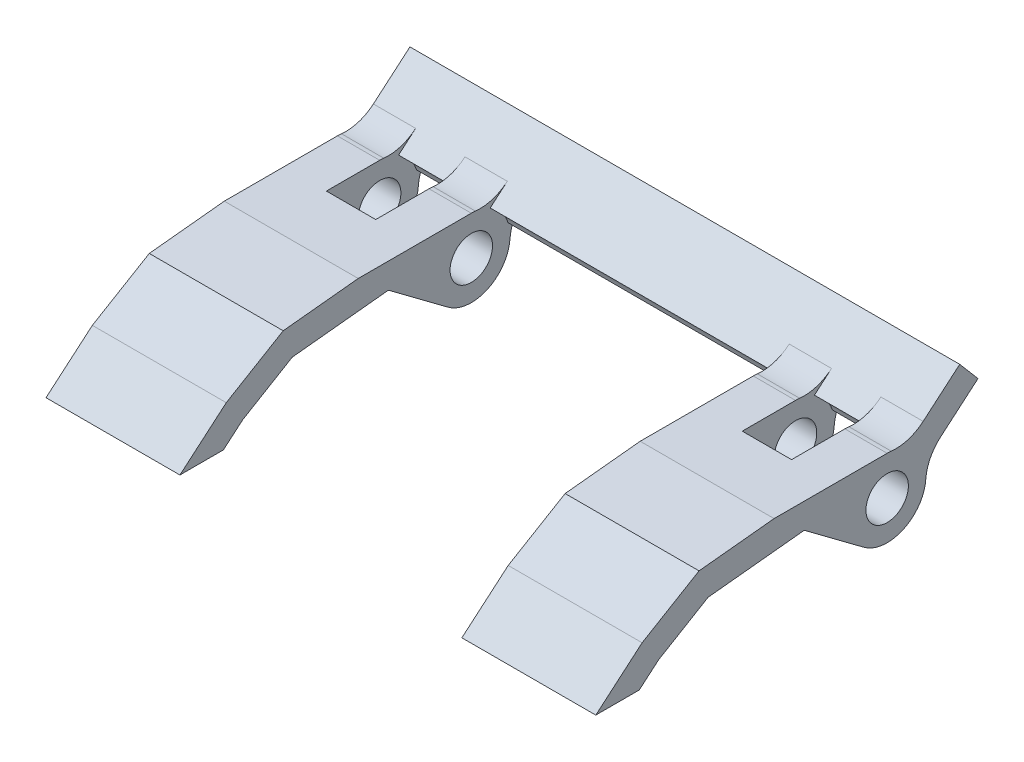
from build123d import *

# Parameters (mm, degrees)
SKETCH_1_W               = 91
SKETCH_1_H               = 36
EXTRUDE_1_DEPTH          = 17
SHELL_1_T                = -1.5
FILLET_1_R               = 2.5
CUT_EXTRUDE_1_REACH      = 53.327
SKETCH_2_W               = 72.5
SKETCH_2_H               = 23
EXTRUDE_2_DEPTH          = 6.5
MIRROR_2_COPY_1_DEPTH    = 6.5
CUT_EXTRUDE_2_REACH      = 96.308
SKETCH_5_W               = 87
SKETCH_5_H               = 31.999999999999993
EXTRUDE_3_DEPTH          = 1.5
SKETCH_6_W               = 3
SKETCH_6_H               = 18
CUT_EXTRUDE_3_DEPTH      = 1.5
PATTERN_LINEAR_1_COUNT   = 3
PATTERN_LINEAR_1_PITCH   = 6
MIRROR_3_COPY_1_SKETCH_W = 3
MIRROR_3_COPY_1_SKETCH_H = 18
MIRROR_3_COPY_1_DEPTH    = 1.5
MIRROR_3_COPY_2_SKETCH_W = 3
MIRROR_3_COPY_2_SKETCH_H = 18
MIRROR_3_COPY_2_DEPTH    = 1.5
EXTRUDE_4_DEPTH          = 1.5
SKETCH_8_R               = 1.5000000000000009
CUT_EXTRUDE_4_DEPTH      = 3
CUT_EXTRUDE_START        = -17
SKETCH_9_W               = 90.99999999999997
SKETCH_9_H               = 36
CUT_EXTRUDE_5_DEPTH      = 17
SKETCH_10_R              = 1.5057624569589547
EXTRUDE_5_DEPTH          = 39
CUT_EXTRUDE_START_2      = -6.601661
CUT_EXTRUDE_6_DEPTH      = 6.601661
EXTRUDE_6_DEPTH          = 39
SKETCH_14_W              = 19.99999999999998
SKETCH_14_H              = 19.910096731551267
CUT_EXTRUDE_7_DEPTH      = 39
SKETCH_15_W              = 31.999999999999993
SKETCH_15_H              = 8.74543491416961
CUT_EXTRUDE_8_DEPTH      = 87
FILLET_4_R               = 3


with BuildPart() as part:
    # Sketch 1 → Extrude 1 (new body)
    with BuildSketch(Plane(origin=(0, 0, 0), x_dir=(1, 0, 0), z_dir=(0, 1, 0))):
        Rectangle(SKETCH_1_W, SKETCH_1_H)
    extrude(amount=EXTRUDE_1_DEPTH)

    # Shell 1
    shell_1_openings = [part.faces().sort_by_distance(p)[0] for p in [
        (0, 17, 0),
    ]]
    offset(amount=SHELL_1_T, openings=shell_1_openings, kind=Kind.INTERSECTION)

    # Fillet 1
    fillet_1_edges = [part.edges().sort_by_distance(p)[0] for p in [
        (45.49999999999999, 8.5, 18),
        (-45.50000000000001, 8.5, 18),
        (-45.50000000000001, 8.5, -18),
        (45.49999999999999, 8.5, -18),
    ]]
    fillet(fillet_1_edges, radius=FILLET_1_R)

    # Sketch 2 → Cut-Extrude 1 (cut, up to next)
    with BuildSketch(Plane(origin=(0, 1.5, 0), x_dir=(1, 0, 0), z_dir=(0, 1, 0)), mode=Mode.PRIVATE) as cut_extrude_1_sk1:
        Rectangle(SKETCH_2_W, SKETCH_2_H)
    cut_extrude_1_tool1 = extrude(cut_extrude_1_sk1.sketch, amount=-CUT_EXTRUDE_1_REACH, mode=Mode.PRIVATE) & part.part
    add(cut_extrude_1_tool1.solids().sort_by_distance((0, 1.5, 0))[0], mode=Mode.SUBTRACT)

    # Sketch 3 → Extrude 2 (add)
    with BuildSketch(Plane(origin=(0, 1.5, 0), x_dir=(1, 0, 0), z_dir=(0, 1, 0))):
        with BuildLine():
            Line((-44.00000000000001, 16.499999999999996), (-41, 16.5))
            ThreePointArc((-41, 16.5), (-38.878679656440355, 11.378679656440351), (-44.00000000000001, 13.499999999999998))
            Line((-44.00000000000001, 13.499999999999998), (-44.00000000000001, 16.499999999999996))
        make_face()
    extrude_2 = extrude(amount=EXTRUDE_2_DEPTH)

    # Mirror 1: Extrude 2 across plane
    add(extrude_2.mirror(Plane(origin=(0, 0, 0), x_dir=(0, 0, 1), z_dir=(1, 0, 0))))

    # Mirror 2: Extrude 2 across plane
    add(extrude_2.mirror(Plane.XY))

    # Mirror 2 copy 1 sketch → Mirror 2 copy 1 (add)
    with BuildSketch(Plane(origin=(0, 1.5, 0), x_dir=(-1, 0, 0), z_dir=(0, 1, 0))):
        with BuildLine():
            Line((-44.00000000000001, 16.499999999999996), (-41, 16.5))
            ThreePointArc((-41, 16.5), (-38.878679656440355, 11.378679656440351), (-44.00000000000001, 13.499999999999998))
            Line((-44.00000000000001, 13.499999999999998), (-44.00000000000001, 16.499999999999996))
        make_face()
    extrude(amount=MIRROR_2_COPY_1_DEPTH)

    # Sketch 4 → Cut-Extrude 2 (cut, up to next)
    with BuildSketch(Plane(origin=(45.49999999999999, 0, 0), x_dir=(0, 0, -1), z_dir=(1, 0, 0)), mode=Mode.PRIVATE) as cut_extrude_2_sk1:
        Polygon((-6.500000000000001, 15.5), (6.499999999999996, 15.500000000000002), (6.499999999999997, 8.5), (-6.500000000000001, 8.5), align=None)
    cut_extrude_2_tool1 = extrude(cut_extrude_2_sk1.sketch, amount=-CUT_EXTRUDE_2_REACH, mode=Mode.PRIVATE) & part.part
    add(cut_extrude_2_tool1.solids().sort_by_distance((45.5, 12, 0))[0], mode=Mode.SUBTRACT)

    # Sketch 9 → Cut-Extrude 5 (cut)
    with BuildSketch(Plane(origin=(0, 17, 0), x_dir=(1, 0, 0), z_dir=(0, 1, 0)).offset(CUT_EXTRUDE_START)):
        Rectangle(SKETCH_9_W, SKETCH_9_H)
    extrude(amount=CUT_EXTRUDE_5_DEPTH, mode=Mode.SUBTRACT)


with BuildPart() as body_2:
    # Sketch 5 → Extrude 3 (new body)
    with BuildSketch(Plane(origin=(0, 17, 0), x_dir=(1, 0, 0), z_dir=(0, 1, 0))):
        Rectangle(SKETCH_5_W, SKETCH_5_H)
    extrude(amount=EXTRUDE_3_DEPTH)

    # Sketch 6 → Cut-Extrude 3 (cut)
    with BuildSketch(Plane(origin=(0, 18.500000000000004, 0), x_dir=(1, 0, 0), z_dir=(0, 1, 0))):
        with Locations((-39, 1.78e-15)):
            Rectangle(SKETCH_6_W, SKETCH_6_H)
    cut_extrude_3 = extrude(amount=-CUT_EXTRUDE_3_DEPTH, mode=Mode.SUBTRACT)

    # Pattern Linear 1: Cut-Extrude 3 ×3
    with Locations(*[(i * PATTERN_LINEAR_1_PITCH, 0, 0) for i in range(1, PATTERN_LINEAR_1_COUNT)]):
        add(cut_extrude_3, mode=Mode.SUBTRACT)

    # Mirror 3: Cut-Extrude 3 across plane
    add(cut_extrude_3.mirror(Plane(origin=(0, 0, 0), x_dir=(0, 0, 1), z_dir=(1, 0, 0))), mode=Mode.SUBTRACT)

    # Mirror 3 copy 1 sketch → Mirror 3 copy 1 (cut)
    with BuildSketch(Plane(origin=(-6, 18.500000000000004, 0), x_dir=(-1, 0, 0), z_dir=(0, 1, 0))):
        with Locations((-39, -1.78e-15)):
            Rectangle(MIRROR_3_COPY_1_SKETCH_W, MIRROR_3_COPY_1_SKETCH_H)
    extrude(amount=-MIRROR_3_COPY_1_DEPTH, mode=Mode.SUBTRACT)

    # Mirror 3 copy 2 sketch → Mirror 3 copy 2 (cut)
    with BuildSketch(Plane(origin=(-12, 18.500000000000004, 0), x_dir=(-1, 0, 0), z_dir=(0, 1, 0))):
        with Locations((-39, -1.78e-15)):
            Rectangle(MIRROR_3_COPY_2_SKETCH_W, MIRROR_3_COPY_2_SKETCH_H)
    extrude(amount=-MIRROR_3_COPY_2_DEPTH, mode=Mode.SUBTRACT)

    # Sketch 7 → Extrude 4 (add, symmetric)
    with BuildSketch(Plane(origin=(-15, 0, 0), x_dir=(0, 0, -1), z_dir=(1, 0, 0))):
        with BuildLine():
            Line((6.464733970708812, 22.52606042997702), (4.999367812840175, 18.500000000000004))
            Line((4.999367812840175, 18.500000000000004), (12.283811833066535, 18.500000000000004))
            Line((12.283811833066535, 18.500000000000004), (12.283811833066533, 21.5))
            ThreePointArc((12.283811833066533, 21.5), (9.804756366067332, 24.45442325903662), (6.464733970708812, 22.52606042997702))
        make_face()
    extrude_4 = extrude(amount=EXTRUDE_4_DEPTH, both=True)

    # Sketch 8 → Cut-Extrude 4 (cut)
    with BuildSketch(Plane(origin=(-13.500000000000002, 0, 0), x_dir=(0, 0, -1), z_dir=(1, 0, 0))):
        with Locations((9.283811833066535, 21.5)):
            Circle(SKETCH_8_R)
    cut_extrude_4 = extrude(amount=-CUT_EXTRUDE_4_DEPTH, mode=Mode.SUBTRACT)

    # Mirror 4: Extrude 4, Cut-Extrude 4 across plane
    add(extrude_4.mirror(Plane(origin=(0, 0, 0), x_dir=(0, 0, 1), z_dir=(1, 0, 0))))
    add(cut_extrude_4.mirror(Plane(origin=(0, 0, 0), x_dir=(0, 0, 1), z_dir=(1, 0, 0))), mode=Mode.SUBTRACT)

    # Sketch 15 → Cut-Extrude 8 (cut)
    with BuildSketch(Plane.ZY.offset(-43.49999999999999)):
        with Locations((0, 21.372717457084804)):
            Rectangle(SKETCH_15_W, SKETCH_15_H)
    extrude(amount=CUT_EXTRUDE_8_DEPTH, mode=Mode.SUBTRACT)


with BuildPart() as body_2_2:
    # Sketch 10 → Extrude 5 (new body)
    with BuildSketch(Plane(origin=(43.49999999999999, 0, 0), x_dir=(0, 0, -1), z_dir=(1, 0, 0))):
        with BuildLine():
            Line((10.63032139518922, 23.901020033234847), (14.436315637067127, 27.143612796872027))
            Line((14.436315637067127, 27.143612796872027), (15.733352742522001, 25.621215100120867))
            Line((15.733352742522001, 25.621215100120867), (11.90248648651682, 22.35743212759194))
            ThreePointArc((11.90248648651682, 22.35743212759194), (10.894482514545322, 19.26689239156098), (7.643849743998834, 19.296799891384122))
            Line((7.643849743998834, 19.296799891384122), (3.4083119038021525, 22.460619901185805))
            Line((3.4083119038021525, 22.460619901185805), (-3.4117957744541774, 21.755763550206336))
            Line((-3.4117957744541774, 21.755763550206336), (-6.92556374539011, 19.668482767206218))
            Line((-6.92556374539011, 19.668482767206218), (-8.296973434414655, 18.500000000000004))
            Line((-8.296973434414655, 18.500000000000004), (-11.380798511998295, 18.500000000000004))
            Line((-11.380798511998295, 18.500000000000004), (-8.093206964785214, 21.301127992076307))
            Line((-8.093206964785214, 21.301127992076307), (-4.054998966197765, 23.699941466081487))
            Line((-4.054998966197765, 23.699941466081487), (1.2673031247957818, 24.25))
            Line((1.2673031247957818, 24.25), (9.289574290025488, 24.25))
            ThreePointArc((9.289574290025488, 24.25), (9.982284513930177, 24.161325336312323), (10.63032139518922, 23.901020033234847))
        make_face()
        with Locations((9.289574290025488, 21.5)):
            Circle(SKETCH_10_R, mode=Mode.SUBTRACT)
    extrude(amount=EXTRUDE_5_DEPTH)

    # Sketch 11 → Cut-Extrude 6 (cut)
    with BuildSketch(Plane.XZ.offset(-18.500000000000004).offset(CUT_EXTRUDE_START_2)):
        Polygon((46.49999999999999, 11.380798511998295), (46.49999999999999, -12.03957429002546), (49.99999999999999, -12.039574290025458), (49.99999999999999, 11.380798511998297), align=None)
        Polygon((53, 11.380798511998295), (72.99999999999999, 11.380798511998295), (72.99999999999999, -12.03957429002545), (53.00000000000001, -12.039574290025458), align=None)
        Polygon((75.99999999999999, 11.380798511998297), (75.99999999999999, -12.03957429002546), (79.49999999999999, -12.03957429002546), (79.49999999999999, 11.380798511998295), align=None)
    extrude(amount=CUT_EXTRUDE_6_DEPTH, mode=Mode.SUBTRACT)

    # Sketch 13 → Extrude 6 (add)
    with BuildSketch(Plane(origin=(82.49999999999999, 0, 0), x_dir=(0, 0, -1), z_dir=(1, 0, 0))):
        with BuildLine():
            Line((12.039574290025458, 25.10166116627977), (10.63032139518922, 23.901020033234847))
            ThreePointArc((10.63032139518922, 23.901020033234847), (11.411724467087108, 23.24899360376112), (11.902486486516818, 22.357432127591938))
            Line((11.902486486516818, 22.357432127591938), (12.039574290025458, 22.474226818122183))
            Line((12.039574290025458, 22.474226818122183), (12.039574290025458, 25.10166116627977))
        make_face()
        Polygon((-3.4117957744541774, 21.755763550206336), (3.4083119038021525, 22.460619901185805), (5.508448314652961, 24.25), (1.2673031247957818, 24.25), (-4.054998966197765, 23.699941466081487), (-8.093206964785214, 21.301127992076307), (-11.380798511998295, 18.500000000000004), (-8.296973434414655, 18.500000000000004), (-6.92556374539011, 19.668482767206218), align=None)
    extrude(amount=-EXTRUDE_6_DEPTH)

    # Sketch 14 → Cut-Extrude 7 (cut)
    with BuildSketch(Plane.XZ.offset(-18.500000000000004)):
        with Locations((63, 4.428967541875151)):
            Rectangle(SKETCH_14_W, SKETCH_14_H)
    extrude(amount=-CUT_EXTRUDE_7_DEPTH, mode=Mode.SUBTRACT)

    # Fillet 4
    fillet_4_edges = [body_2_2.edges().sort_by_distance(p)[0] for p in [
        (74.49999999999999, 23.901020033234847, -10.63032139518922),
        (74.49999999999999, 22.35743212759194, -11.90248648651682),
        (81, 23.901020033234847, -10.63032139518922),
        (81, 22.35743212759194, -11.90248648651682),
        (44.99999999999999, 23.901020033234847, -10.63032139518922),
        (44.99999999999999, 22.35743212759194, -11.90248648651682),
        (51.5, 23.901020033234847, -10.63032139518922),
        (51.5, 22.35743212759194, -11.90248648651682),
    ]]
    fillet(fillet_4_edges, radius=FILLET_4_R)


solid = body_2_2.part
